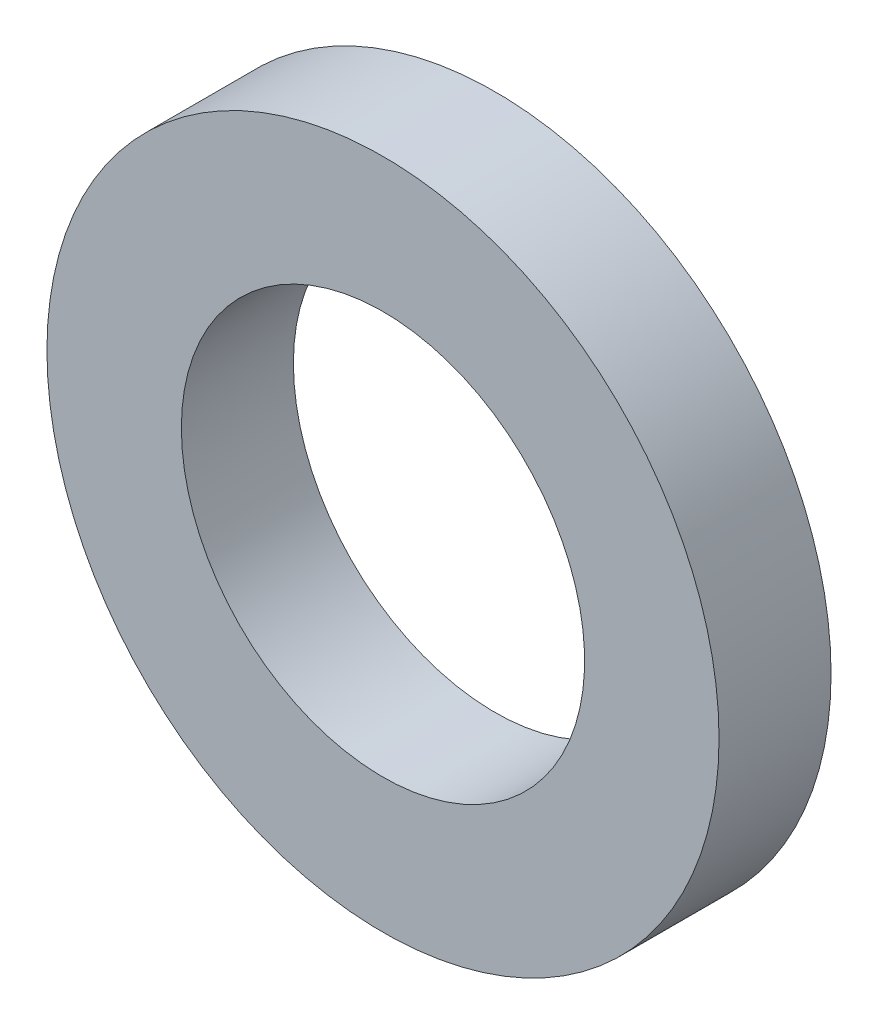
from build123d import *

# Parameters (mm, degrees)
SKETCH1_R          = 19.05
BASE_EXTRUDE_DEPTH = 6.35
SKETCH3_R          = 11.43
CUT_EXTRUDE1_DEPTH = 28.679008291


with BuildPart() as part:
    # Sketch1 → Base-Extrude (new body)
    with BuildSketch(Plane.XY):
        Circle(SKETCH1_R)
    extrude(amount=BASE_EXTRUDE_DEPTH)

    # Sketch3 → Cut-Extrude1 (cut, through all)
    with BuildSketch(Plane(origin=(0, 0, 0), x_dir=(-1, 0, 0), z_dir=(0, 0, -1))):
        Circle(SKETCH3_R)
    extrude(amount=-CUT_EXTRUDE1_DEPTH, mode=Mode.SUBTRACT)


solid = part.part
